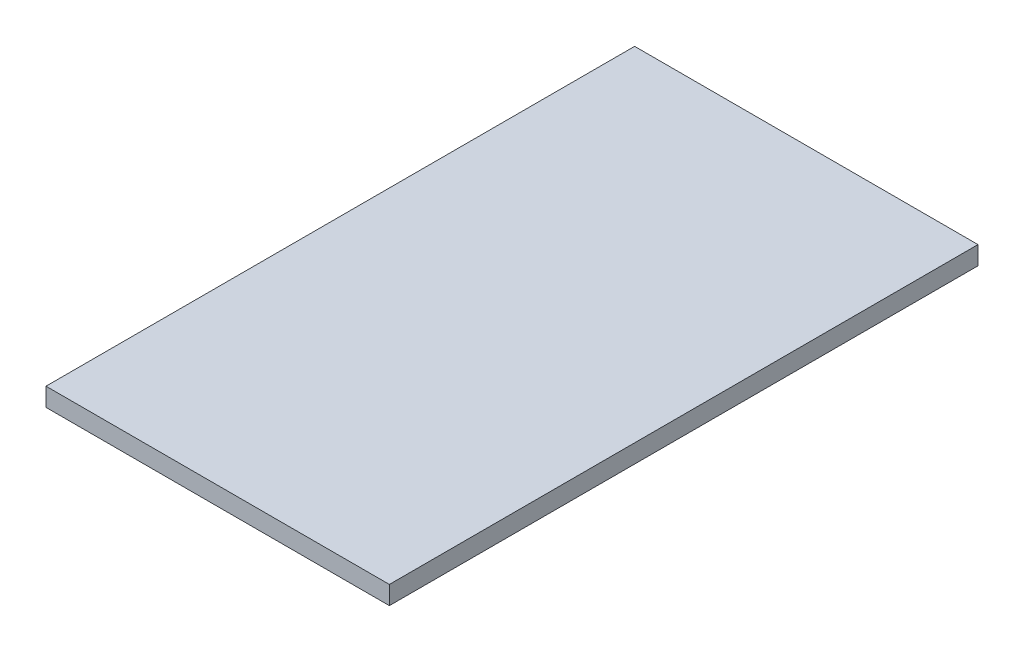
from build123d import *

# Parameters (mm, degrees)
SKETCH1_W           = 88.9
SKETCH1_H           = 152.4
BOSS_EXTRUDE1_DEPTH = 4.7625


with BuildPart() as part:
    # Sketch1 → Boss-Extrude1 (new body)
    with BuildSketch(Plane(origin=(0, 0, 0), x_dir=(1, 0, 0), z_dir=(0, 1, 0))):
        with Locations((44.45, 76.2)):
            Rectangle(SKETCH1_W, SKETCH1_H)
    extrude(amount=BOSS_EXTRUDE1_DEPTH)


solid = part.part
